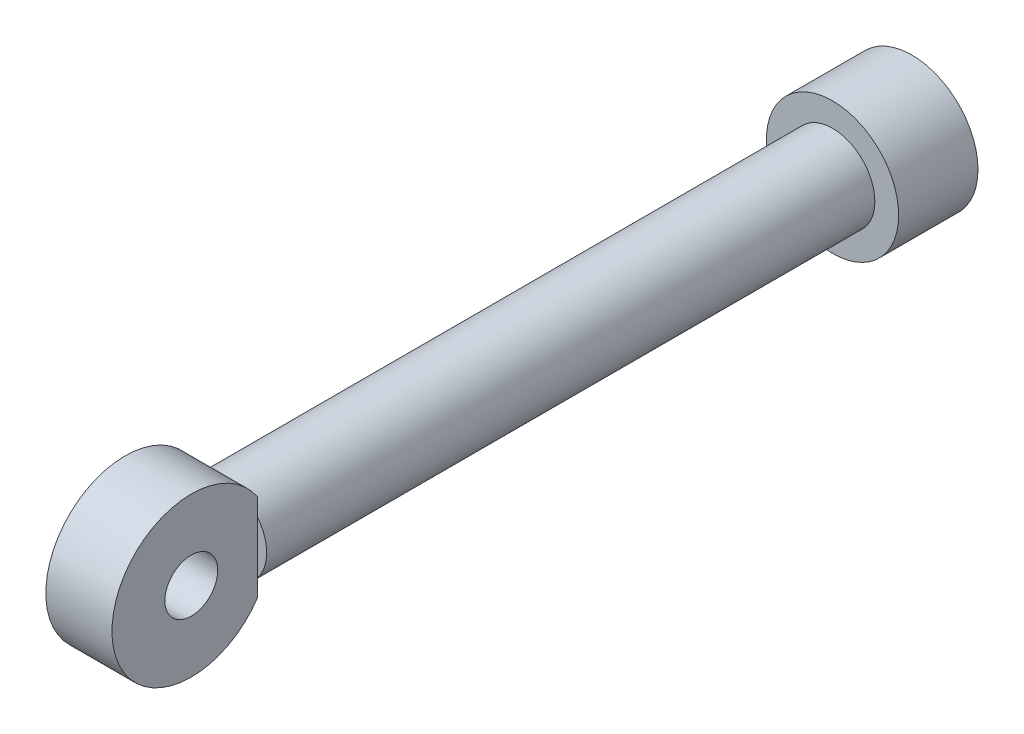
ISO-10303-21;
HEADER;
FILE_DESCRIPTION(('STEP AP214'),'2;1');
FILE_NAME('part.step','',(''),(''),'','','');
FILE_SCHEMA(('AUTOMOTIVE_DESIGN { 1 0 10303 214 1 1 1 1 }'));
ENDSEC;
DATA;
#1=APPLICATION_CONTEXT('core data for automotive mechanical design processes');
#2=APPLICATION_PROTOCOL_DEFINITION('international standard','automotive_design',2000,#1);
#3=PRODUCT_CONTEXT('',#1,'mechanical');
#4=PRODUCT('Part','Part','',(#3));
#5=PRODUCT_RELATED_PRODUCT_CATEGORY('part','',(#4));
#6=PRODUCT_DEFINITION_FORMATION('','',#4);
#7=PRODUCT_DEFINITION_CONTEXT('part definition',#1,'design');
#8=PRODUCT_DEFINITION('design','',#6,#7);
#9=PRODUCT_DEFINITION_SHAPE('','',#8);
#10=(LENGTH_UNIT() NAMED_UNIT(*) SI_UNIT(.MILLI.,.METRE.));
#11=(NAMED_UNIT(*) PLANE_ANGLE_UNIT() SI_UNIT($,.RADIAN.));
#12=(NAMED_UNIT(*) SI_UNIT($,.STERADIAN.) SOLID_ANGLE_UNIT());
#13=UNCERTAINTY_MEASURE_WITH_UNIT(LENGTH_MEASURE(1.E-05),#10,'distance_accuracy_value','');
#14=(GEOMETRIC_REPRESENTATION_CONTEXT(3) GLOBAL_UNCERTAINTY_ASSIGNED_CONTEXT((#13)) GLOBAL_UNIT_ASSIGNED_CONTEXT((#10,
#11,#12)) REPRESENTATION_CONTEXT('',''));
#15=CARTESIAN_POINT('',(0.,0.,0.));
#16=DIRECTION('',(0.,0.,1.));
#17=DIRECTION('',(1.,0.,0.));
#18=AXIS2_PLACEMENT_3D('',#15,#16,#17);
#19=CARTESIAN_POINT('',(0.,0.,260.));
#20=DIRECTION('',(0.,0.,1.));
#21=DIRECTION('',(1.,0.,0.));
#22=AXIS2_PLACEMENT_3D('',#19,#20,#21);
#23=PLANE('',#22);
#24=CARTESIAN_POINT('',(0.,0.,260.));
#25=DIRECTION('',(0.,0.,1.));
#26=DIRECTION('',(1.,0.,0.));
#27=AXIS2_PLACEMENT_3D('',#24,#25,#26);
#28=CIRCLE('',#27,16.);
#29=CARTESIAN_POINT('',(-12.5,9.98749217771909,260.));
#30=VERTEX_POINT('',#29);
#31=CARTESIAN_POINT('',(-12.5,-9.98749217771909,260.));
#32=VERTEX_POINT('',#31);
#33=EDGE_CURVE('E117',#30,#32,#28,.T.);
#34=ORIENTED_EDGE('',*,*,#33,.T.);
#35=DIRECTION('',(0.,1.,0.));
#36=VECTOR('',#35,1.);
#37=CARTESIAN_POINT('',(-12.5,0.,260.));
#38=LINE('',#37,#36);
#39=EDGE_CURVE('E47',#32,#30,#38,.T.);
#40=ORIENTED_EDGE('',*,*,#39,.T.);
#41=EDGE_LOOP('',(#34,#40));
#42=FACE_BOUND('',#41,.T.);
#43=ADVANCED_FACE('F39',(#42),#23,.T.);
#44=CARTESIAN_POINT('',(0.,0.,30.));
#45=DIRECTION('',(0.,0.,1.));
#46=DIRECTION('',(1.,0.,0.));
#47=AXIS2_PLACEMENT_3D('',#44,#45,#46);
#48=PLANE('',#47);
#49=CARTESIAN_POINT('',(0.,0.,30.));
#50=DIRECTION('',(0.,0.,1.));
#51=DIRECTION('',(1.,0.,0.));
#52=AXIS2_PLACEMENT_3D('',#49,#50,#51);
#53=CIRCLE('',#52,25.);
#54=CARTESIAN_POINT('',(25.,0.,30.));
#55=VERTEX_POINT('',#54);
#56=EDGE_CURVE('E120',#55,#55,#53,.T.);
#57=ORIENTED_EDGE('',*,*,#56,.T.);
#58=EDGE_LOOP('',(#57));
#59=FACE_BOUND('',#58,.T.);
#60=CARTESIAN_POINT('',(0.,0.,30.));
#61=DIRECTION('',(0.,0.,1.));
#62=DIRECTION('',(1.,0.,0.));
#63=AXIS2_PLACEMENT_3D('',#60,#61,#62);
#64=CIRCLE('',#63,16.);
#65=CARTESIAN_POINT('',(16.,0.,30.));
#66=VERTEX_POINT('',#65);
#67=EDGE_CURVE('E96',#66,#66,#64,.T.);
#68=ORIENTED_EDGE('',*,*,#67,.F.);
#69=EDGE_LOOP('',(#68));
#70=FACE_BOUND('',#69,.T.);
#71=ADVANCED_FACE('F149',(#59,#70),#48,.T.);
#72=CARTESIAN_POINT('',(0.,0.,30.));
#73=DIRECTION('',(0.,0.,-1.));
#74=DIRECTION('',(-1.,0.,0.));
#75=AXIS2_PLACEMENT_3D('',#72,#73,#74);
#76=CYLINDRICAL_SURFACE('',#75,25.);
#77=ORIENTED_EDGE('',*,*,#56,.F.);
#78=EDGE_LOOP('',(#77));
#79=FACE_BOUND('',#78,.T.);
#80=CARTESIAN_POINT('',(0.,0.,0.));
#81=DIRECTION('',(0.,0.,1.));
#82=DIRECTION('',(1.,0.,0.));
#83=AXIS2_PLACEMENT_3D('',#80,#81,#82);
#84=CIRCLE('',#83,25.);
#85=CARTESIAN_POINT('',(25.,0.,0.));
#86=VERTEX_POINT('',#85);
#87=EDGE_CURVE('E116',#86,#86,#84,.T.);
#88=ORIENTED_EDGE('',*,*,#87,.T.);
#89=EDGE_LOOP('',(#88));
#90=FACE_BOUND('',#89,.T.);
#91=ADVANCED_FACE('F41',(#79,#90),#76,.T.);
#92=CARTESIAN_POINT('',(0.,0.,0.));
#93=DIRECTION('',(0.,0.,1.));
#94=DIRECTION('',(1.,0.,0.));
#95=AXIS2_PLACEMENT_3D('',#92,#93,#94);
#96=PLANE('',#95);
#97=ORIENTED_EDGE('',*,*,#87,.F.);
#98=EDGE_LOOP('',(#97));
#99=FACE_BOUND('',#98,.T.);
#100=ADVANCED_FACE('F157',(#99),#96,.F.);
#101=CARTESIAN_POINT('',(0.,0.,260.));
#102=DIRECTION('',(0.,0.,-1.));
#103=DIRECTION('',(-1.,0.,0.));
#104=AXIS2_PLACEMENT_3D('',#101,#102,#103);
#105=CYLINDRICAL_SURFACE('',#104,16.);
#106=CARTESIAN_POINT('',(12.5,9.98749217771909,260.));
#107=VERTEX_POINT('',#106);
#108=EDGE_CURVE('E114',#107,#30,#28,.T.);
#109=ORIENTED_EDGE('',*,*,#108,.F.);
#110=CARTESIAN_POINT('',(12.5,-9.98749217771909,260.));
#111=VERTEX_POINT('',#110);
#112=EDGE_CURVE('E113',#111,#107,#28,.T.);
#113=ORIENTED_EDGE('',*,*,#112,.F.);
#114=EDGE_CURVE('E130',#32,#111,#28,.T.);
#115=ORIENTED_EDGE('',*,*,#114,.F.);
#116=ORIENTED_EDGE('',*,*,#33,.F.);
#117=EDGE_LOOP('',(#109,#113,#115,#116));
#118=FACE_BOUND('',#117,.T.);
#119=ORIENTED_EDGE('',*,*,#67,.T.);
#120=EDGE_LOOP('',(#119));
#121=FACE_BOUND('',#120,.T.);
#122=ADVANCED_FACE('F127',(#118,#121),#105,.T.);
#123=DIRECTION('',(0.,1.,0.));
#124=VECTOR('',#123,1.);
#125=CARTESIAN_POINT('',(12.5,0.,260.));
#126=LINE('',#125,#124);
#127=EDGE_CURVE('E11',#111,#107,#126,.T.);
#128=ORIENTED_EDGE('',*,*,#127,.F.);
#129=ORIENTED_EDGE('',*,*,#112,.T.);
#130=EDGE_LOOP('',(#128,#129));
#131=FACE_BOUND('',#130,.T.);
#132=ADVANCED_FACE('F134',(#131),#23,.T.);
#133=CARTESIAN_POINT('',(12.5,16.583123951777,260.));
#134=DIRECTION('',(0.,0.,1.));
#135=DIRECTION('',(1.,0.,0.));
#136=AXIS2_PLACEMENT_3D('',#133,#134,#135);
#137=PLANE('',#136);
#138=DIRECTION('',(0.,1.,0.));
#139=VECTOR('',#138,1.);
#140=CARTESIAN_POINT('',(12.5,16.583123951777,260.));
#141=LINE('',#140,#139);
#142=CARTESIAN_POINT('',(12.5,16.583123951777,260.));
#143=VERTEX_POINT('',#142);
#144=EDGE_CURVE('E61',#107,#143,#141,.T.);
#145=ORIENTED_EDGE('',*,*,#144,.F.);
#146=ORIENTED_EDGE('',*,*,#108,.T.);
#147=DIRECTION('',(0.,1.,0.));
#148=VECTOR('',#147,1.);
#149=CARTESIAN_POINT('',(-12.5,16.583123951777,260.));
#150=LINE('',#149,#148);
#151=CARTESIAN_POINT('',(-12.5,16.583123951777,260.));
#152=VERTEX_POINT('',#151);
#153=EDGE_CURVE('E54',#30,#152,#150,.T.);
#154=ORIENTED_EDGE('',*,*,#153,.T.);
#155=DIRECTION('',(-1.,0.,0.));
#156=VECTOR('',#155,1.);
#157=CARTESIAN_POINT('',(12.5,16.583123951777,260.));
#158=LINE('',#157,#156);
#159=EDGE_CURVE('E97',#143,#152,#158,.T.);
#160=ORIENTED_EDGE('',*,*,#159,.F.);
#161=EDGE_LOOP('',(#145,#146,#154,#160));
#162=FACE_BOUND('',#161,.T.);
#163=ADVANCED_FACE('F138',(#162),#137,.F.);
#164=CARTESIAN_POINT('',(-12.5,-16.583123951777,260.));
#165=VERTEX_POINT('',#164);
#166=EDGE_CURVE('E77',#165,#32,#150,.T.);
#167=ORIENTED_EDGE('',*,*,#166,.T.);
#168=ORIENTED_EDGE('',*,*,#114,.T.);
#169=CARTESIAN_POINT('',(12.5,-16.583123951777,260.));
#170=VERTEX_POINT('',#169);
#171=EDGE_CURVE('E92',#170,#111,#141,.T.);
#172=ORIENTED_EDGE('',*,*,#171,.F.);
#173=DIRECTION('',(-1.,0.,0.));
#174=VECTOR('',#173,1.);
#175=CARTESIAN_POINT('',(12.5,-16.583123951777,260.));
#176=LINE('',#175,#174);
#177=EDGE_CURVE('E89',#170,#165,#176,.T.);
#178=ORIENTED_EDGE('',*,*,#177,.T.);
#179=EDGE_LOOP('',(#167,#168,#172,#178));
#180=FACE_BOUND('',#179,.T.);
#181=ADVANCED_FACE('F90',(#180),#137,.F.);
#182=CARTESIAN_POINT('',(12.5,0.,285.));
#183=DIRECTION('',(1.,0.,0.));
#184=DIRECTION('',(0.,0.,-1.));
#185=AXIS2_PLACEMENT_3D('',#182,#183,#184);
#186=PLANE('',#185);
#187=CARTESIAN_POINT('',(12.5,0.,285.));
#188=DIRECTION('',(1.,0.,0.));
#189=DIRECTION('',(0.,0.,-1.));
#190=AXIS2_PLACEMENT_3D('',#187,#188,#189);
#191=CIRCLE('',#190,30.);
#192=EDGE_CURVE('E86',#143,#170,#191,.T.);
#193=ORIENTED_EDGE('',*,*,#192,.T.);
#194=ORIENTED_EDGE('',*,*,#171,.T.);
#195=ORIENTED_EDGE('',*,*,#127,.T.);
#196=ORIENTED_EDGE('',*,*,#144,.T.);
#197=EDGE_LOOP('',(#193,#194,#195,#196));
#198=FACE_BOUND('',#197,.T.);
#199=CARTESIAN_POINT('',(12.5,0.,285.));
#200=DIRECTION('',(1.,0.,0.));
#201=DIRECTION('',(0.,0.,-1.));
#202=AXIS2_PLACEMENT_3D('',#199,#200,#201);
#203=CIRCLE('',#202,9.99999999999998);
#204=CARTESIAN_POINT('',(12.5,0.,275.));
#205=VERTEX_POINT('',#204);
#206=EDGE_CURVE('E101',#205,#205,#203,.T.);
#207=ORIENTED_EDGE('',*,*,#206,.F.);
#208=EDGE_LOOP('',(#207));
#209=FACE_BOUND('',#208,.T.);
#210=ADVANCED_FACE('F136',(#198,#209),#186,.T.);
#211=CARTESIAN_POINT('',(-12.5,0.,285.));
#212=DIRECTION('',(1.,0.,0.));
#213=DIRECTION('',(0.,0.,-1.));
#214=AXIS2_PLACEMENT_3D('',#211,#212,#213);
#215=PLANE('',#214);
#216=CARTESIAN_POINT('',(-12.5,0.,285.));
#217=DIRECTION('',(1.,0.,0.));
#218=DIRECTION('',(0.,0.,-1.));
#219=AXIS2_PLACEMENT_3D('',#216,#217,#218);
#220=CIRCLE('',#219,30.);
#221=EDGE_CURVE('E82',#152,#165,#220,.T.);
#222=ORIENTED_EDGE('',*,*,#221,.F.);
#223=ORIENTED_EDGE('',*,*,#153,.F.);
#224=ORIENTED_EDGE('',*,*,#39,.F.);
#225=ORIENTED_EDGE('',*,*,#166,.F.);
#226=EDGE_LOOP('',(#222,#223,#224,#225));
#227=FACE_BOUND('',#226,.T.);
#228=CARTESIAN_POINT('',(-12.5,0.,285.));
#229=DIRECTION('',(1.,0.,0.));
#230=DIRECTION('',(0.,0.,-1.));
#231=AXIS2_PLACEMENT_3D('',#228,#229,#230);
#232=CIRCLE('',#231,9.99999999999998);
#233=CARTESIAN_POINT('',(-12.5,0.,275.));
#234=VERTEX_POINT('',#233);
#235=EDGE_CURVE('E104',#234,#234,#232,.T.);
#236=ORIENTED_EDGE('',*,*,#235,.T.);
#237=EDGE_LOOP('',(#236));
#238=FACE_BOUND('',#237,.T.);
#239=ADVANCED_FACE('F79',(#227,#238),#215,.F.);
#240=CARTESIAN_POINT('',(12.5,0.,285.));
#241=DIRECTION('',(-1.,0.,0.));
#242=DIRECTION('',(0.,0.,1.));
#243=AXIS2_PLACEMENT_3D('',#240,#241,#242);
#244=CYLINDRICAL_SURFACE('',#243,30.);
#245=ORIENTED_EDGE('',*,*,#221,.T.);
#246=ORIENTED_EDGE('',*,*,#177,.F.);
#247=ORIENTED_EDGE('',*,*,#192,.F.);
#248=ORIENTED_EDGE('',*,*,#159,.T.);
#249=EDGE_LOOP('',(#245,#246,#247,#248));
#250=FACE_BOUND('',#249,.T.);
#251=ADVANCED_FACE('F100',(#250),#244,.T.);
#252=CARTESIAN_POINT('',(12.5,0.,285.));
#253=DIRECTION('',(-1.,0.,0.));
#254=DIRECTION('',(0.,0.,1.));
#255=AXIS2_PLACEMENT_3D('',#252,#253,#254);
#256=CYLINDRICAL_SURFACE('',#255,9.99999999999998);
#257=ORIENTED_EDGE('',*,*,#206,.T.);
#258=EDGE_LOOP('',(#257));
#259=FACE_BOUND('',#258,.T.);
#260=ORIENTED_EDGE('',*,*,#235,.F.);
#261=EDGE_LOOP('',(#260));
#262=FACE_BOUND('',#261,.T.);
#263=ADVANCED_FACE('F211',(#259,#262),#256,.F.);
#264=CLOSED_SHELL('',(#43,#71,#91,#100,#122,#132,#163,#181,#210,#239,#251,#263));
#265=MANIFOLD_SOLID_BREP('B2',#264);
#266=ADVANCED_BREP_SHAPE_REPRESENTATION('',(#18,#265),#14);
#267=SHAPE_DEFINITION_REPRESENTATION(#9,#266);
ENDSEC;
END-ISO-10303-21;
